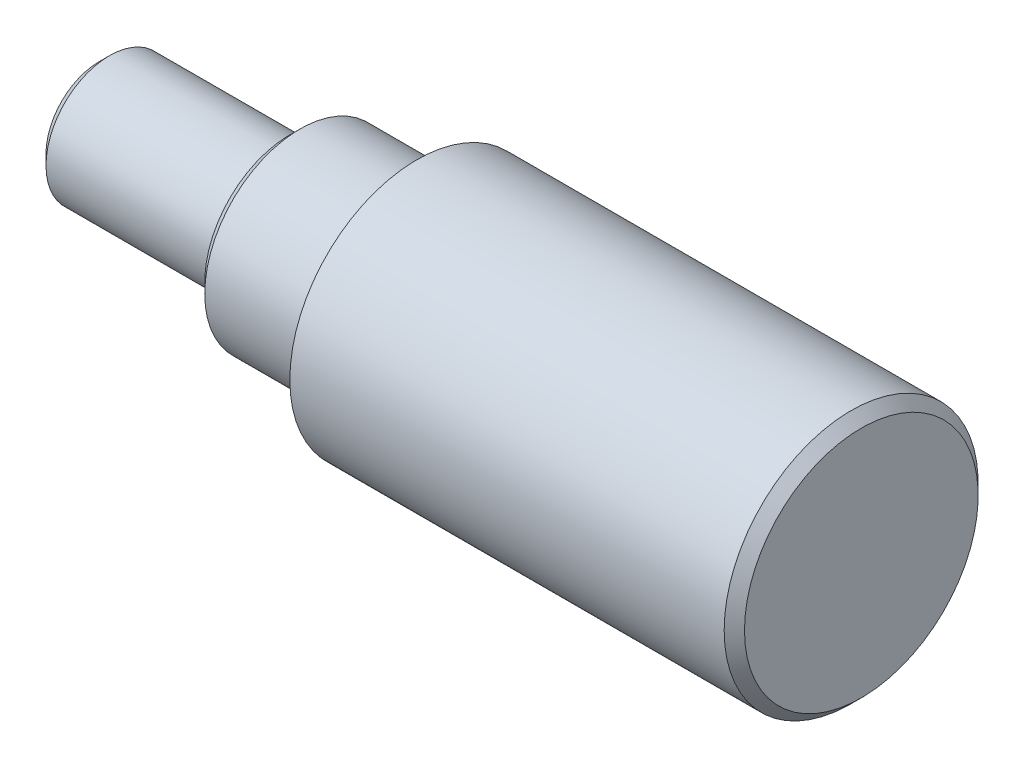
ISO-10303-21;
HEADER;
FILE_DESCRIPTION(('STEP AP214'),'2;1');
FILE_NAME('part.step','',(''),(''),'','','');
FILE_SCHEMA(('AUTOMOTIVE_DESIGN { 1 0 10303 214 1 1 1 1 }'));
ENDSEC;
DATA;
#1=APPLICATION_CONTEXT('core data for automotive mechanical design processes');
#2=APPLICATION_PROTOCOL_DEFINITION('international standard','automotive_design',2000,#1);
#3=PRODUCT_CONTEXT('',#1,'mechanical');
#4=PRODUCT('Part','Part','',(#3));
#5=PRODUCT_RELATED_PRODUCT_CATEGORY('part','',(#4));
#6=PRODUCT_DEFINITION_FORMATION('','',#4);
#7=PRODUCT_DEFINITION_CONTEXT('part definition',#1,'design');
#8=PRODUCT_DEFINITION('design','',#6,#7);
#9=PRODUCT_DEFINITION_SHAPE('','',#8);
#10=(LENGTH_UNIT() NAMED_UNIT(*) SI_UNIT(.MILLI.,.METRE.));
#11=(NAMED_UNIT(*) PLANE_ANGLE_UNIT() SI_UNIT($,.RADIAN.));
#12=(NAMED_UNIT(*) SI_UNIT($,.STERADIAN.) SOLID_ANGLE_UNIT());
#13=UNCERTAINTY_MEASURE_WITH_UNIT(LENGTH_MEASURE(1.E-05),#10,'distance_accuracy_value','');
#14=(GEOMETRIC_REPRESENTATION_CONTEXT(3) GLOBAL_UNCERTAINTY_ASSIGNED_CONTEXT((#13)) GLOBAL_UNIT_ASSIGNED_CONTEXT((#10,
#11,#12)) REPRESENTATION_CONTEXT('',''));
#15=CARTESIAN_POINT('',(0.,0.,0.));
#16=DIRECTION('',(0.,0.,1.));
#17=DIRECTION('',(1.,0.,0.));
#18=AXIS2_PLACEMENT_3D('',#15,#16,#17);
#19=CARTESIAN_POINT('',(0.,0.,0.));
#20=DIRECTION('',(1.,0.,0.));
#21=DIRECTION('',(0.,0.,-1.));
#22=AXIS2_PLACEMENT_3D('',#19,#20,#21);
#23=PLANE('',#22);
#24=CARTESIAN_POINT('',(0.,0.,0.));
#25=DIRECTION('',(1.,0.,0.));
#26=DIRECTION('',(0.,0.,-1.));
#27=AXIS2_PLACEMENT_3D('',#24,#25,#26);
#28=CIRCLE('',#27,2.667);
#29=CARTESIAN_POINT('',(0.,0.,-2.667));
#30=VERTEX_POINT('',#29);
#31=EDGE_CURVE('E48',#30,#30,#28,.F.);
#32=ORIENTED_EDGE('',*,*,#31,.T.);
#33=EDGE_LOOP('',(#32));
#34=FACE_BOUND('',#33,.T.);
#35=ADVANCED_FACE('F34',(#34),#23,.F.);
#36=CARTESIAN_POINT('',(0.,0.,0.));
#37=DIRECTION('',(-1.,0.,0.));
#38=DIRECTION('',(0.,0.,1.));
#39=AXIS2_PLACEMENT_3D('',#36,#37,#38);
#40=CYLINDRICAL_SURFACE('',#39,3.175);
#41=CARTESIAN_POINT('',(0.508000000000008,0.,0.));
#42=DIRECTION('',(1.,0.,0.));
#43=DIRECTION('',(0.,0.,-1.));
#44=AXIS2_PLACEMENT_3D('',#41,#42,#43);
#45=CIRCLE('',#44,3.175);
#46=CARTESIAN_POINT('',(0.508000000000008,0.,-3.175));
#47=VERTEX_POINT('',#46);
#48=EDGE_CURVE('E44',#47,#47,#45,.T.);
#49=ORIENTED_EDGE('',*,*,#48,.T.);
#50=EDGE_LOOP('',(#49));
#51=FACE_BOUND('',#50,.T.);
#52=CARTESIAN_POINT('',(9.52499999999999,0.,0.));
#53=DIRECTION('',(-1.,0.,0.));
#54=DIRECTION('',(0.,0.,1.));
#55=AXIS2_PLACEMENT_3D('',#52,#53,#54);
#56=CIRCLE('',#55,3.175);
#57=CARTESIAN_POINT('',(9.52499999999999,0.,3.175));
#58=VERTEX_POINT('',#57);
#59=EDGE_CURVE('E59',#58,#58,#56,.T.);
#60=ORIENTED_EDGE('',*,*,#59,.T.);
#61=EDGE_LOOP('',(#60));
#62=FACE_BOUND('',#61,.T.);
#63=ADVANCED_FACE('F85',(#51,#62),#40,.T.);
#64=CARTESIAN_POINT('',(9.52499999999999,3.175,0.));
#65=DIRECTION('',(1.,0.,0.));
#66=DIRECTION('',(0.,0.,-1.));
#67=AXIS2_PLACEMENT_3D('',#64,#65,#66);
#68=PLANE('',#67);
#69=CARTESIAN_POINT('',(9.52499999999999,0.,0.));
#70=DIRECTION('',(1.,0.,0.));
#71=DIRECTION('',(0.,0.,-1.));
#72=AXIS2_PLACEMENT_3D('',#69,#70,#71);
#73=CIRCLE('',#72,4.2545);
#74=CARTESIAN_POINT('',(9.52499999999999,0.,-4.2545));
#75=VERTEX_POINT('',#74);
#76=EDGE_CURVE('E56',#75,#75,#73,.F.);
#77=ORIENTED_EDGE('',*,*,#76,.T.);
#78=EDGE_LOOP('',(#77));
#79=FACE_BOUND('',#78,.T.);
#80=ORIENTED_EDGE('',*,*,#59,.F.);
#81=EDGE_LOOP('',(#80));
#82=FACE_BOUND('',#81,.T.);
#83=ADVANCED_FACE('F90',(#79,#82),#68,.F.);
#84=CARTESIAN_POINT('',(0.,0.,0.));
#85=DIRECTION('',(-1.,0.,0.));
#86=DIRECTION('',(0.,0.,1.));
#87=AXIS2_PLACEMENT_3D('',#84,#85,#86);
#88=CYLINDRICAL_SURFACE('',#87,4.7625);
#89=CARTESIAN_POINT('',(10.033,0.,0.));
#90=DIRECTION('',(1.,0.,0.));
#91=DIRECTION('',(0.,0.,-1.));
#92=AXIS2_PLACEMENT_3D('',#89,#90,#91);
#93=CIRCLE('',#92,4.7625);
#94=CARTESIAN_POINT('',(10.033,0.,-4.7625));
#95=VERTEX_POINT('',#94);
#96=EDGE_CURVE('E53',#95,#95,#93,.T.);
#97=ORIENTED_EDGE('',*,*,#96,.T.);
#98=EDGE_LOOP('',(#97));
#99=FACE_BOUND('',#98,.T.);
#100=CARTESIAN_POINT('',(15.875,0.,0.));
#101=DIRECTION('',(-1.,0.,0.));
#102=DIRECTION('',(0.,0.,1.));
#103=AXIS2_PLACEMENT_3D('',#100,#101,#102);
#104=CIRCLE('',#103,4.7625);
#105=CARTESIAN_POINT('',(15.875,0.,4.7625));
#106=VERTEX_POINT('',#105);
#107=EDGE_CURVE('E62',#106,#106,#104,.T.);
#108=ORIENTED_EDGE('',*,*,#107,.T.);
#109=EDGE_LOOP('',(#108));
#110=FACE_BOUND('',#109,.T.);
#111=ADVANCED_FACE('F81',(#99,#110),#88,.T.);
#112=CARTESIAN_POINT('',(15.875,4.7625,0.));
#113=DIRECTION('',(1.,0.,0.));
#114=DIRECTION('',(0.,0.,-1.));
#115=AXIS2_PLACEMENT_3D('',#112,#113,#114);
#116=PLANE('',#115);
#117=ORIENTED_EDGE('',*,*,#107,.F.);
#118=EDGE_LOOP('',(#117));
#119=FACE_BOUND('',#118,.T.);
#120=CARTESIAN_POINT('',(15.875,0.,0.));
#121=DIRECTION('',(-1.,0.,0.));
#122=DIRECTION('',(0.,0.,1.));
#123=AXIS2_PLACEMENT_3D('',#120,#121,#122);
#124=CIRCLE('',#123,6.35);
#125=CARTESIAN_POINT('',(15.875,0.,6.35));
#126=VERTEX_POINT('',#125);
#127=EDGE_CURVE('E65',#126,#126,#124,.T.);
#128=ORIENTED_EDGE('',*,*,#127,.T.);
#129=EDGE_LOOP('',(#128));
#130=FACE_BOUND('',#129,.T.);
#131=ADVANCED_FACE('F69',(#119,#130),#116,.F.);
#132=CARTESIAN_POINT('',(0.,0.,0.));
#133=DIRECTION('',(-1.,0.,0.));
#134=DIRECTION('',(0.,0.,1.));
#135=AXIS2_PLACEMENT_3D('',#132,#133,#134);
#136=CYLINDRICAL_SURFACE('',#135,6.35);
#137=CARTESIAN_POINT('',(37.592,0.,0.));
#138=DIRECTION('',(-1.,0.,0.));
#139=DIRECTION('',(0.,0.,1.));
#140=AXIS2_PLACEMENT_3D('',#137,#138,#139);
#141=CIRCLE('',#140,6.35);
#142=CARTESIAN_POINT('',(37.592,0.,6.35));
#143=VERTEX_POINT('',#142);
#144=EDGE_CURVE('E40',#143,#143,#141,.T.);
#145=ORIENTED_EDGE('',*,*,#144,.T.);
#146=EDGE_LOOP('',(#145));
#147=FACE_BOUND('',#146,.T.);
#148=ORIENTED_EDGE('',*,*,#127,.F.);
#149=EDGE_LOOP('',(#148));
#150=FACE_BOUND('',#149,.T.);
#151=ADVANCED_FACE('F71',(#147,#150),#136,.T.);
#152=CARTESIAN_POINT('',(38.1,6.35,0.));
#153=DIRECTION('',(-1.,0.,0.));
#154=DIRECTION('',(0.,0.,1.));
#155=AXIS2_PLACEMENT_3D('',#152,#153,#154);
#156=PLANE('',#155);
#157=CARTESIAN_POINT('',(38.1,0.,0.));
#158=DIRECTION('',(-1.,0.,0.));
#159=DIRECTION('',(0.,0.,1.));
#160=AXIS2_PLACEMENT_3D('',#157,#158,#159);
#161=CIRCLE('',#160,5.842);
#162=CARTESIAN_POINT('',(38.1,0.,5.842));
#163=VERTEX_POINT('',#162);
#164=EDGE_CURVE('E10',#163,#163,#161,.F.);
#165=ORIENTED_EDGE('',*,*,#164,.T.);
#166=EDGE_LOOP('',(#165));
#167=FACE_BOUND('',#166,.T.);
#168=ADVANCED_FACE('F73',(#167),#156,.F.);
#169=CARTESIAN_POINT('',(9.52499999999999,0.,0.));
#170=DIRECTION('',(1.,0.,0.));
#171=DIRECTION('',(0.,0.,-1.));
#172=AXIS2_PLACEMENT_3D('',#169,#170,#171);
#173=CONICAL_SURFACE('',#172,4.2545,0.785398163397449);
#174=ORIENTED_EDGE('',*,*,#96,.F.);
#175=EDGE_LOOP('',(#174));
#176=FACE_BOUND('',#175,.T.);
#177=ORIENTED_EDGE('',*,*,#76,.F.);
#178=EDGE_LOOP('',(#177));
#179=FACE_BOUND('',#178,.T.);
#180=ADVANCED_FACE('F79',(#176,#179),#173,.T.);
#181=CARTESIAN_POINT('',(0.,0.,0.));
#182=DIRECTION('',(1.,0.,0.));
#183=DIRECTION('',(0.,0.,-1.));
#184=AXIS2_PLACEMENT_3D('',#181,#182,#183);
#185=CONICAL_SURFACE('',#184,2.667,0.785398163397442);
#186=ORIENTED_EDGE('',*,*,#48,.F.);
#187=EDGE_LOOP('',(#186));
#188=FACE_BOUND('',#187,.T.);
#189=ORIENTED_EDGE('',*,*,#31,.F.);
#190=EDGE_LOOP('',(#189));
#191=FACE_BOUND('',#190,.T.);
#192=ADVANCED_FACE('F94',(#188,#191),#185,.T.);
#193=CARTESIAN_POINT('',(37.592,0.,0.));
#194=DIRECTION('',(-1.,0.,0.));
#195=DIRECTION('',(0.,0.,1.));
#196=AXIS2_PLACEMENT_3D('',#193,#194,#195);
#197=CONICAL_SURFACE('',#196,6.35,0.78539816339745);
#198=ORIENTED_EDGE('',*,*,#164,.F.);
#199=EDGE_LOOP('',(#198));
#200=FACE_BOUND('',#199,.T.);
#201=ORIENTED_EDGE('',*,*,#144,.F.);
#202=EDGE_LOOP('',(#201));
#203=FACE_BOUND('',#202,.T.);
#204=ADVANCED_FACE('F96',(#200,#203),#197,.T.);
#205=CLOSED_SHELL('',(#35,#63,#83,#111,#131,#151,#168,#180,#192,#204));
#206=MANIFOLD_SOLID_BREP('B2',#205);
#207=ADVANCED_BREP_SHAPE_REPRESENTATION('',(#18,#206),#14);
#208=SHAPE_DEFINITION_REPRESENTATION(#9,#207);
ENDSEC;
END-ISO-10303-21;
